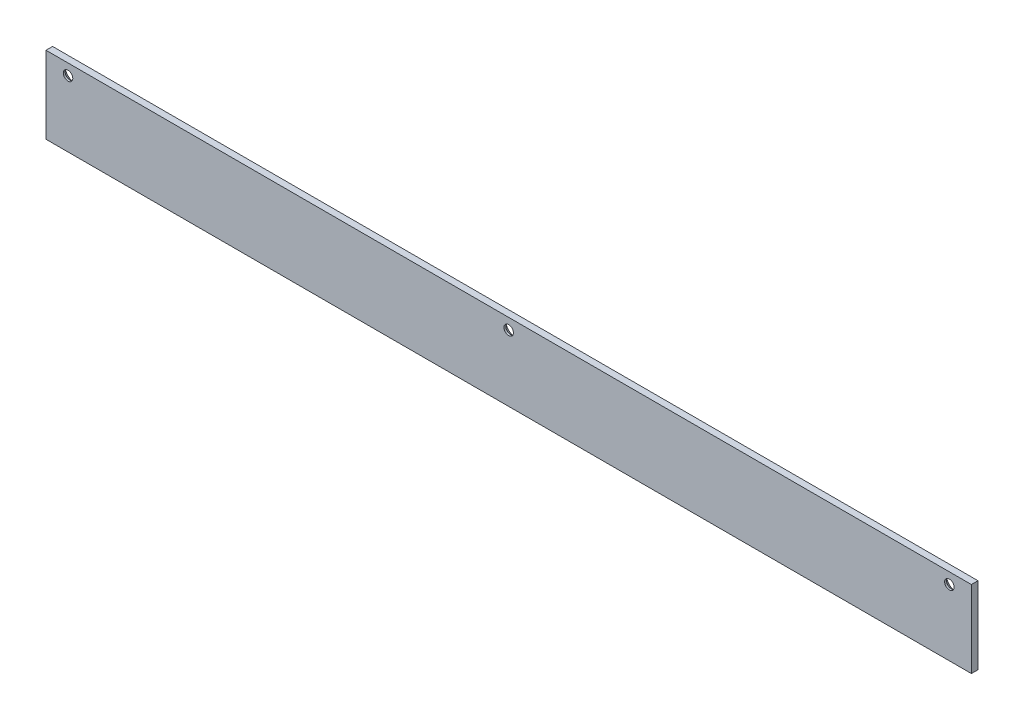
from build123d import *

# Parameters (mm, degrees)
SKETCH_1_W          = 420
SKETCH_1_H          = 35
EXTRUDE_1_DEPTH     = 3
SKETCH_2_R          = 4.3
CUT_EXTRUDE_1_DEPTH = 2.15
DRAFT_1_ANGLE       = 45
SKETCH_4_R          = 2.15
CUT_EXTRUDE_2_DEPTH = 422.46129419
SKETCH_5_R          = 2.15
CUT_EXTRUDE_3_DEPTH = 422.46129419
SKETCH_6_R          = 2.15
CUT_EXTRUDE_4_DEPTH = 422.46129419


with BuildPart() as part:
    # Sketch 1 → Extrude 1 (new body)
    with BuildSketch(Plane.XY):
        with Locations((210, 17.5)):
            Rectangle(SKETCH_1_W, SKETCH_1_H)
    extrude(amount=EXTRUDE_1_DEPTH)

    # Sketch 2 → Cut-Extrude 1 (cut)
    with BuildSketch(Plane(origin=(0, 0, 0), x_dir=(-1, 0, 0), z_dir=(0, 0, -1))):
        with Locations((-410, 30)):
            Circle(SKETCH_2_R)
        with Locations((-210, 30)):
            Circle(SKETCH_2_R)
        with Locations((-10, 30)):
            Circle(SKETCH_2_R)
    extrude(amount=-CUT_EXTRUDE_1_DEPTH, mode=Mode.SUBTRACT)

    # Draft 1
    draft_1_faces = [part.faces().sort_by_distance(p)[0] for p in [
        (14.3, 30, 1.075),
        (214.3, 30, 1.075),
        (414.3, 30, 1.075),
    ]]
    draft(draft_1_faces, Plane(origin=(0, 0, 0), x_dir=(-1, 0, 0), z_dir=(0, 0, -1)), DRAFT_1_ANGLE)

    # Sketch 4 → Cut-Extrude 2 (cut, through all)
    with BuildSketch(Plane(origin=(0, 0, 2.15), x_dir=(-1, 0, 0), z_dir=(0, 0, -1))):
        with Locations((-410, 30)):
            Circle(SKETCH_4_R)
    extrude(amount=-CUT_EXTRUDE_2_DEPTH, mode=Mode.SUBTRACT)

    # Sketch 5 → Cut-Extrude 3 (cut, through all)
    with BuildSketch(Plane(origin=(0, 0, 2.15), x_dir=(-1, 0, 0), z_dir=(0, 0, -1))):
        with Locations((-210, 30)):
            Circle(SKETCH_5_R)
    extrude(amount=-CUT_EXTRUDE_3_DEPTH, mode=Mode.SUBTRACT)

    # Sketch 6 → Cut-Extrude 4 (cut, through all)
    with BuildSketch(Plane(origin=(0, 0, 2.15), x_dir=(-1, 0, 0), z_dir=(0, 0, -1))):
        with Locations((-10, 30)):
            Circle(SKETCH_6_R)
    extrude(amount=-CUT_EXTRUDE_4_DEPTH, mode=Mode.SUBTRACT)


solid = part.part
